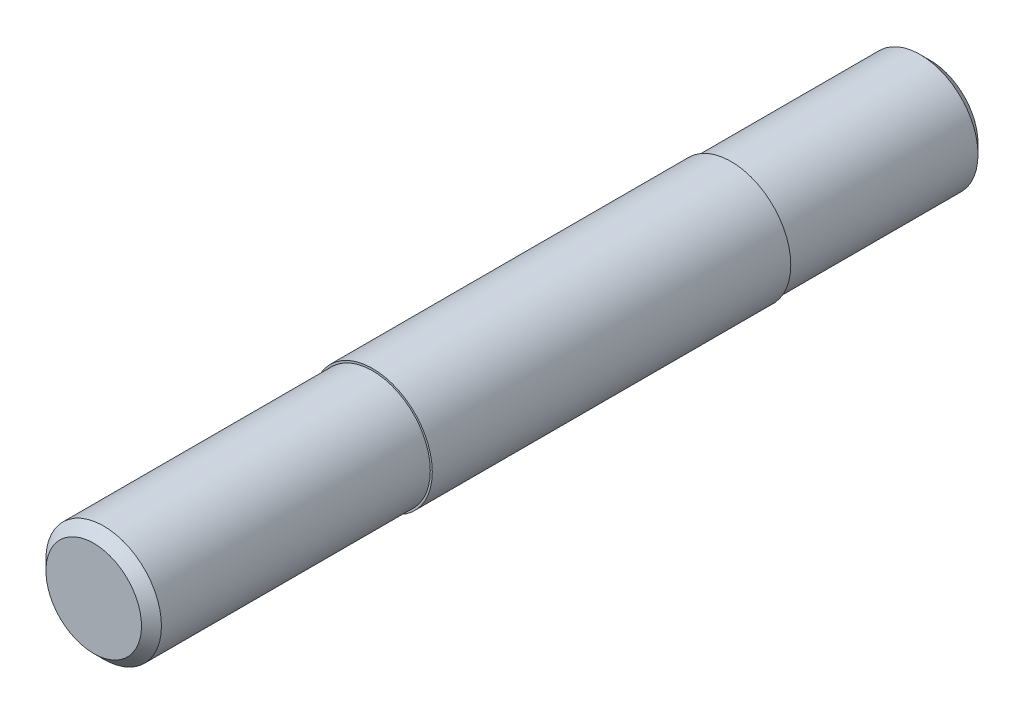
from build123d import *

# Parameters (mm, degrees)
ESQUISSE3_R          = 2.9
BASE_EXTRUSION_DEPTH = 10
ESQUISSE4_R          = 3
BOSS_EXTRU_1_DEPTH   = 18
ESQUISSE5_R          = 2.9
BOSS_EXTRU_2_DEPTH   = 14
CHANFREIN1_SIZE      = 0.5


with BuildPart() as part:
    # Esquisse3 → Base-Extrusion (new body)
    with BuildSketch(Plane.XY):
        Circle(ESQUISSE3_R)
    extrude(amount=BASE_EXTRUSION_DEPTH)

    # Esquisse4 → Boss.-Extru.1 (add)
    with BuildSketch(Plane.XY.offset(10)):
        Circle(ESQUISSE4_R)
    extrude(amount=BOSS_EXTRU_1_DEPTH)

    # Esquisse5 → Boss.-Extru.2 (add)
    with BuildSketch(Plane.XY.offset(28)):
        Circle(ESQUISSE5_R)
    extrude(amount=BOSS_EXTRU_2_DEPTH)

    # Chanfrein1
    chanfrein1_edges = [part.edges().sort_by_distance(p)[0] for p in [
        (-2.9, 0, 0),
        (-2.9, 0, 42),
    ]]
    chamfer(chanfrein1_edges, length=CHANFREIN1_SIZE)


solid = part.part
